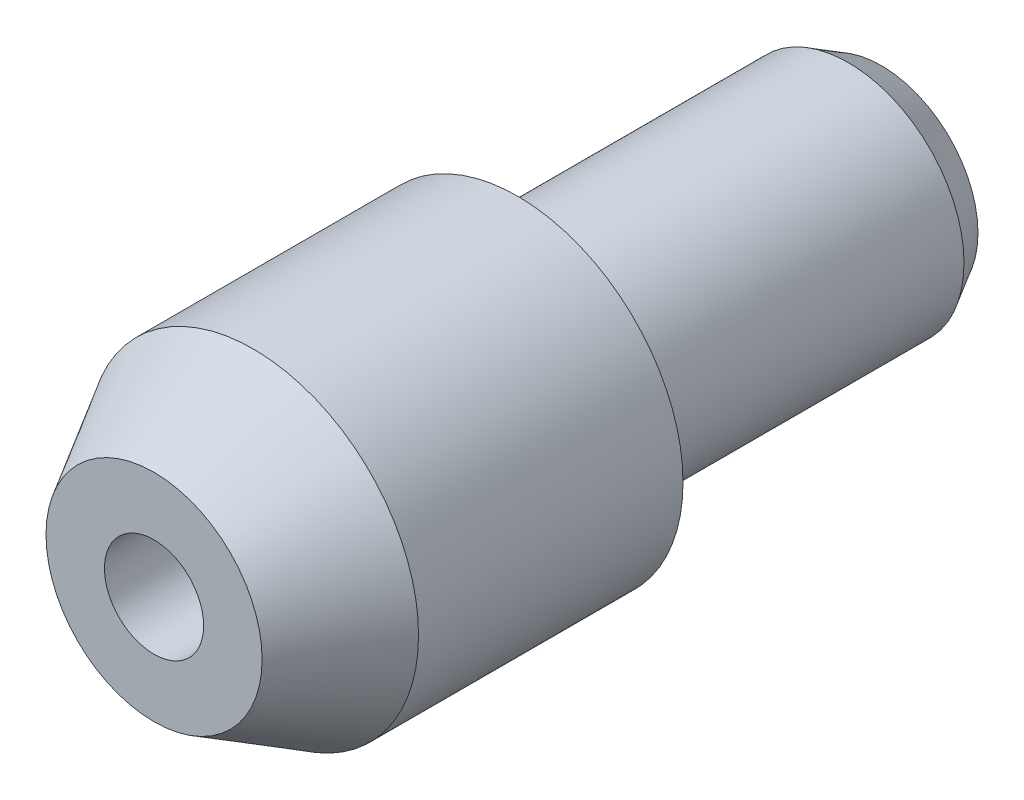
ISO-10303-21;
HEADER;
FILE_DESCRIPTION(('STEP AP214'),'2;1');
FILE_NAME('part.step','',(''),(''),'','','');
FILE_SCHEMA(('AUTOMOTIVE_DESIGN { 1 0 10303 214 1 1 1 1 }'));
ENDSEC;
DATA;
#1=APPLICATION_CONTEXT('core data for automotive mechanical design processes');
#2=APPLICATION_PROTOCOL_DEFINITION('international standard','automotive_design',2000,#1);
#3=PRODUCT_CONTEXT('',#1,'mechanical');
#4=PRODUCT('Part','Part','',(#3));
#5=PRODUCT_RELATED_PRODUCT_CATEGORY('part','',(#4));
#6=PRODUCT_DEFINITION_FORMATION('','',#4);
#7=PRODUCT_DEFINITION_CONTEXT('part definition',#1,'design');
#8=PRODUCT_DEFINITION('design','',#6,#7);
#9=PRODUCT_DEFINITION_SHAPE('','',#8);
#10=(LENGTH_UNIT() NAMED_UNIT(*) SI_UNIT(.MILLI.,.METRE.));
#11=(NAMED_UNIT(*) PLANE_ANGLE_UNIT() SI_UNIT($,.RADIAN.));
#12=(NAMED_UNIT(*) SI_UNIT($,.STERADIAN.) SOLID_ANGLE_UNIT());
#13=UNCERTAINTY_MEASURE_WITH_UNIT(LENGTH_MEASURE(1.E-05),#10,'distance_accuracy_value','');
#14=(GEOMETRIC_REPRESENTATION_CONTEXT(3) GLOBAL_UNCERTAINTY_ASSIGNED_CONTEXT((#13)) GLOBAL_UNIT_ASSIGNED_CONTEXT((#10,
#11,#12)) REPRESENTATION_CONTEXT('',''));
#15=CARTESIAN_POINT('',(0.,0.,0.));
#16=DIRECTION('',(0.,0.,1.));
#17=DIRECTION('',(1.,0.,0.));
#18=AXIS2_PLACEMENT_3D('',#15,#16,#17);
#19=CARTESIAN_POINT('',(0.,0.,-10.));
#20=DIRECTION('',(0.,0.,1.));
#21=DIRECTION('',(1.,0.,0.));
#22=AXIS2_PLACEMENT_3D('',#19,#20,#21);
#23=CONICAL_SURFACE('',#22,3.5,0.523598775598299);
#24=CARTESIAN_POINT('',(0.,0.,-11.));
#25=DIRECTION('',(0.,0.,1.));
#26=DIRECTION('',(1.,0.,0.));
#27=AXIS2_PLACEMENT_3D('',#24,#25,#26);
#28=CIRCLE('',#27,2.92264973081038);
#29=CARTESIAN_POINT('',(2.92264973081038,0.,-11.));
#30=VERTEX_POINT('',#29);
#31=EDGE_CURVE('E43',#30,#30,#28,.T.);
#32=ORIENTED_EDGE('',*,*,#31,.T.);
#33=EDGE_LOOP('',(#32));
#34=FACE_BOUND('',#33,.T.);
#35=CARTESIAN_POINT('',(0.,0.,-10.));
#36=DIRECTION('',(0.,0.,1.));
#37=DIRECTION('',(1.,0.,0.));
#38=AXIS2_PLACEMENT_3D('',#35,#36,#37);
#39=CIRCLE('',#38,3.5);
#40=CARTESIAN_POINT('',(3.5,0.,-10.));
#41=VERTEX_POINT('',#40);
#42=EDGE_CURVE('E8',#41,#41,#39,.T.);
#43=ORIENTED_EDGE('',*,*,#42,.F.);
#44=EDGE_LOOP('',(#43));
#45=FACE_BOUND('',#44,.T.);
#46=ADVANCED_FACE('F12',(#34,#45),#23,.T.);
#47=CARTESIAN_POINT('',(0.,0.,20.));
#48=DIRECTION('',(0.,0.,1.));
#49=DIRECTION('',(1.,0.,0.));
#50=AXIS2_PLACEMENT_3D('',#47,#48,#49);
#51=CYLINDRICAL_SURFACE('',#50,3.5);
#52=ORIENTED_EDGE('',*,*,#42,.T.);
#53=EDGE_LOOP('',(#52));
#54=FACE_BOUND('',#53,.T.);
#55=CARTESIAN_POINT('',(0.,0.,0.));
#56=DIRECTION('',(0.,0.,1.));
#57=DIRECTION('',(1.,0.,0.));
#58=AXIS2_PLACEMENT_3D('',#55,#56,#57);
#59=CIRCLE('',#58,3.5);
#60=CARTESIAN_POINT('',(3.5,0.,0.));
#61=VERTEX_POINT('',#60);
#62=EDGE_CURVE('E18',#61,#61,#59,.T.);
#63=ORIENTED_EDGE('',*,*,#62,.F.);
#64=EDGE_LOOP('',(#63));
#65=FACE_BOUND('',#64,.T.);
#66=ADVANCED_FACE('F72',(#54,#65),#51,.T.);
#67=CARTESIAN_POINT('',(3.5,0.,0.));
#68=DIRECTION('',(0.,0.,1.));
#69=DIRECTION('',(1.,0.,0.));
#70=AXIS2_PLACEMENT_3D('',#67,#68,#69);
#71=PLANE('',#70);
#72=CARTESIAN_POINT('',(0.,0.,0.));
#73=DIRECTION('',(0.,0.,1.));
#74=DIRECTION('',(1.,0.,0.));
#75=AXIS2_PLACEMENT_3D('',#72,#73,#74);
#76=CIRCLE('',#75,5.);
#77=CARTESIAN_POINT('',(5.,0.,0.));
#78=VERTEX_POINT('',#77);
#79=EDGE_CURVE('E22',#78,#78,#76,.T.);
#80=ORIENTED_EDGE('',*,*,#79,.F.);
#81=EDGE_LOOP('',(#80));
#82=FACE_BOUND('',#81,.T.);
#83=ORIENTED_EDGE('',*,*,#62,.T.);
#84=EDGE_LOOP('',(#83));
#85=FACE_BOUND('',#84,.T.);
#86=ADVANCED_FACE('F77',(#82,#85),#71,.F.);
#87=CARTESIAN_POINT('',(0.,0.,20.));
#88=DIRECTION('',(0.,0.,1.));
#89=DIRECTION('',(1.,0.,0.));
#90=AXIS2_PLACEMENT_3D('',#87,#88,#89);
#91=CYLINDRICAL_SURFACE('',#90,5.);
#92=ORIENTED_EDGE('',*,*,#79,.T.);
#93=EDGE_LOOP('',(#92));
#94=FACE_BOUND('',#93,.T.);
#95=CARTESIAN_POINT('',(0.,0.,8.));
#96=DIRECTION('',(0.,0.,1.));
#97=DIRECTION('',(1.,0.,0.));
#98=AXIS2_PLACEMENT_3D('',#95,#96,#97);
#99=CIRCLE('',#98,5.);
#100=CARTESIAN_POINT('',(5.,0.,8.));
#101=VERTEX_POINT('',#100);
#102=EDGE_CURVE('E26',#101,#101,#99,.T.);
#103=ORIENTED_EDGE('',*,*,#102,.F.);
#104=EDGE_LOOP('',(#103));
#105=FACE_BOUND('',#104,.T.);
#106=ADVANCED_FACE('F68',(#94,#105),#91,.T.);
#107=CARTESIAN_POINT('',(0.,0.,8.));
#108=DIRECTION('',(0.,0.,-1.));
#109=DIRECTION('',(-1.,0.,0.));
#110=AXIS2_PLACEMENT_3D('',#107,#108,#109);
#111=CONICAL_SURFACE('',#110,5.,0.523598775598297);
#112=CARTESIAN_POINT('',(0.,0.,11.));
#113=DIRECTION('',(0.,0.,1.));
#114=DIRECTION('',(1.,0.,0.));
#115=AXIS2_PLACEMENT_3D('',#112,#113,#114);
#116=CIRCLE('',#115,3.26794919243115);
#117=CARTESIAN_POINT('',(3.26794919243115,0.,11.));
#118=VERTEX_POINT('',#117);
#119=EDGE_CURVE('E31',#118,#118,#116,.T.);
#120=ORIENTED_EDGE('',*,*,#119,.F.);
#121=EDGE_LOOP('',(#120));
#122=FACE_BOUND('',#121,.T.);
#123=ORIENTED_EDGE('',*,*,#102,.T.);
#124=EDGE_LOOP('',(#123));
#125=FACE_BOUND('',#124,.T.);
#126=ADVANCED_FACE('F61',(#122,#125),#111,.T.);
#127=CARTESIAN_POINT('',(1.5,0.,11.));
#128=DIRECTION('',(0.,0.,1.));
#129=DIRECTION('',(1.,0.,0.));
#130=AXIS2_PLACEMENT_3D('',#127,#128,#129);
#131=PLANE('',#130);
#132=ORIENTED_EDGE('',*,*,#119,.T.);
#133=EDGE_LOOP('',(#132));
#134=FACE_BOUND('',#133,.T.);
#135=CARTESIAN_POINT('',(0.,0.,11.));
#136=DIRECTION('',(0.,0.,1.));
#137=DIRECTION('',(1.,0.,0.));
#138=AXIS2_PLACEMENT_3D('',#135,#136,#137);
#139=CIRCLE('',#138,1.5);
#140=CARTESIAN_POINT('',(1.5,0.,11.));
#141=VERTEX_POINT('',#140);
#142=EDGE_CURVE('E34',#141,#141,#139,.T.);
#143=ORIENTED_EDGE('',*,*,#142,.F.);
#144=EDGE_LOOP('',(#143));
#145=FACE_BOUND('',#144,.T.);
#146=ADVANCED_FACE('F56',(#134,#145),#131,.T.);
#147=CARTESIAN_POINT('',(0.,0.,20.));
#148=DIRECTION('',(0.,0.,1.));
#149=DIRECTION('',(1.,0.,0.));
#150=AXIS2_PLACEMENT_3D('',#147,#148,#149);
#151=CYLINDRICAL_SURFACE('',#150,1.5);
#152=CARTESIAN_POINT('',(0.,0.,6.5));
#153=DIRECTION('',(0.,0.,1.));
#154=DIRECTION('',(1.,0.,0.));
#155=AXIS2_PLACEMENT_3D('',#152,#153,#154);
#156=CIRCLE('',#155,1.5);
#157=CARTESIAN_POINT('',(1.5,0.,6.5));
#158=VERTEX_POINT('',#157);
#159=EDGE_CURVE('E46',#158,#158,#156,.T.);
#160=ORIENTED_EDGE('',*,*,#159,.F.);
#161=EDGE_LOOP('',(#160));
#162=FACE_BOUND('',#161,.T.);
#163=ORIENTED_EDGE('',*,*,#142,.T.);
#164=EDGE_LOOP('',(#163));
#165=FACE_BOUND('',#164,.T.);
#166=ADVANCED_FACE('F52',(#162,#165),#151,.F.);
#167=CARTESIAN_POINT('',(0.,0.,-7.));
#168=DIRECTION('',(0.,0.,1.));
#169=DIRECTION('',(1.,0.,0.));
#170=AXIS2_PLACEMENT_3D('',#167,#168,#169);
#171=PLANE('',#170);
#172=CARTESIAN_POINT('',(0.,0.,-7.));
#173=DIRECTION('',(0.,0.,1.));
#174=DIRECTION('',(1.,0.,0.));
#175=AXIS2_PLACEMENT_3D('',#172,#173,#174);
#176=CIRCLE('',#175,1.);
#177=CARTESIAN_POINT('',(1.,0.,-7.));
#178=VERTEX_POINT('',#177);
#179=EDGE_CURVE('E37',#178,#178,#176,.T.);
#180=ORIENTED_EDGE('',*,*,#179,.F.);
#181=EDGE_LOOP('',(#180));
#182=FACE_BOUND('',#181,.T.);
#183=ADVANCED_FACE('F55',(#182),#171,.F.);
#184=CARTESIAN_POINT('',(0.,0.,20.));
#185=DIRECTION('',(0.,0.,1.));
#186=DIRECTION('',(1.,0.,0.));
#187=AXIS2_PLACEMENT_3D('',#184,#185,#186);
#188=CYLINDRICAL_SURFACE('',#187,1.);
#189=CARTESIAN_POINT('',(0.,0.,-11.));
#190=DIRECTION('',(0.,0.,1.));
#191=DIRECTION('',(1.,0.,0.));
#192=AXIS2_PLACEMENT_3D('',#189,#190,#191);
#193=CIRCLE('',#192,1.);
#194=CARTESIAN_POINT('',(1.,0.,-11.));
#195=VERTEX_POINT('',#194);
#196=EDGE_CURVE('E40',#195,#195,#193,.T.);
#197=ORIENTED_EDGE('',*,*,#196,.F.);
#198=EDGE_LOOP('',(#197));
#199=FACE_BOUND('',#198,.T.);
#200=ORIENTED_EDGE('',*,*,#179,.T.);
#201=EDGE_LOOP('',(#200));
#202=FACE_BOUND('',#201,.T.);
#203=ADVANCED_FACE('F84',(#199,#202),#188,.F.);
#204=CARTESIAN_POINT('',(1.,0.,-11.));
#205=DIRECTION('',(0.,0.,1.));
#206=DIRECTION('',(1.,0.,0.));
#207=AXIS2_PLACEMENT_3D('',#204,#205,#206);
#208=PLANE('',#207);
#209=ORIENTED_EDGE('',*,*,#31,.F.);
#210=EDGE_LOOP('',(#209));
#211=FACE_BOUND('',#210,.T.);
#212=ORIENTED_EDGE('',*,*,#196,.T.);
#213=EDGE_LOOP('',(#212));
#214=FACE_BOUND('',#213,.T.);
#215=ADVANCED_FACE('F81',(#211,#214),#208,.F.);
#216=CARTESIAN_POINT('',(0.,0.,6.5));
#217=DIRECTION('',(0.,0.,1.));
#218=DIRECTION('',(1.,0.,0.));
#219=AXIS2_PLACEMENT_3D('',#216,#217,#218);
#220=PLANE('',#219);
#221=ORIENTED_EDGE('',*,*,#159,.T.);
#222=EDGE_LOOP('',(#221));
#223=FACE_BOUND('',#222,.T.);
#224=ADVANCED_FACE('F50',(#223),#220,.T.);
#225=CLOSED_SHELL('',(#46,#66,#86,#106,#126,#146,#166,#183,#203,#215,#224));
#226=MANIFOLD_SOLID_BREP('B1',#225);
#227=ADVANCED_BREP_SHAPE_REPRESENTATION('',(#18,#226),#14);
#228=SHAPE_DEFINITION_REPRESENTATION(#9,#227);
ENDSEC;
END-ISO-10303-21;
